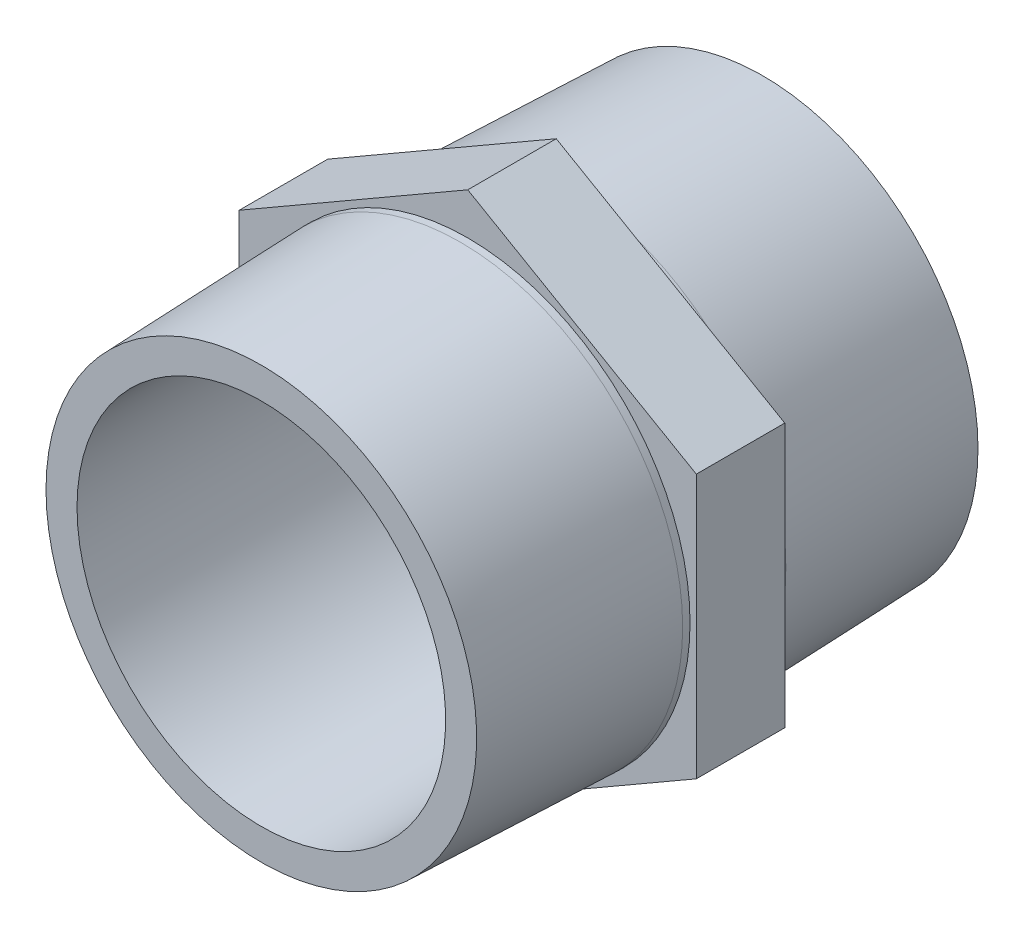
ISO-10303-21;
HEADER;
FILE_DESCRIPTION(('STEP AP214'),'2;1');
FILE_NAME('part.step','',(''),(''),'','','');
FILE_SCHEMA(('AUTOMOTIVE_DESIGN { 1 0 10303 214 1 1 1 1 }'));
ENDSEC;
DATA;
#1=APPLICATION_CONTEXT('core data for automotive mechanical design processes');
#2=APPLICATION_PROTOCOL_DEFINITION('international standard','automotive_design',2000,#1);
#3=PRODUCT_CONTEXT('',#1,'mechanical');
#4=PRODUCT('Part','Part','',(#3));
#5=PRODUCT_RELATED_PRODUCT_CATEGORY('part','',(#4));
#6=PRODUCT_DEFINITION_FORMATION('','',#4);
#7=PRODUCT_DEFINITION_CONTEXT('part definition',#1,'design');
#8=PRODUCT_DEFINITION('design','',#6,#7);
#9=PRODUCT_DEFINITION_SHAPE('','',#8);
#10=(LENGTH_UNIT() NAMED_UNIT(*) SI_UNIT(.MILLI.,.METRE.));
#11=(NAMED_UNIT(*) PLANE_ANGLE_UNIT() SI_UNIT($,.RADIAN.));
#12=(NAMED_UNIT(*) SI_UNIT($,.STERADIAN.) SOLID_ANGLE_UNIT());
#13=UNCERTAINTY_MEASURE_WITH_UNIT(LENGTH_MEASURE(1.E-05),#10,'distance_accuracy_value','');
#14=(GEOMETRIC_REPRESENTATION_CONTEXT(3) GLOBAL_UNCERTAINTY_ASSIGNED_CONTEXT((#13)) GLOBAL_UNIT_ASSIGNED_CONTEXT((#10,
#11,#12)) REPRESENTATION_CONTEXT('',''));
#15=CARTESIAN_POINT('',(0.,0.,0.));
#16=DIRECTION('',(0.,0.,1.));
#17=DIRECTION('',(1.,0.,0.));
#18=AXIS2_PLACEMENT_3D('',#15,#16,#17);
#19=CARTESIAN_POINT('',(30.15,0.,-6.));
#20=DIRECTION('',(0.,0.,1.));
#21=DIRECTION('',(1.,0.,0.));
#22=AXIS2_PLACEMENT_3D('',#19,#20,#21);
#23=PLANE('',#22);
#24=CARTESIAN_POINT('',(0.,0.,-6.));
#25=DIRECTION('',(0.,0.,-1.));
#26=DIRECTION('',(-1.,0.,0.));
#27=AXIS2_PLACEMENT_3D('',#24,#25,#26);
#28=CIRCLE('',#27,30.15);
#29=CARTESIAN_POINT('',(-30.15,0.,-6.));
#30=VERTEX_POINT('',#29);
#31=EDGE_CURVE('E146',#30,#30,#28,.T.);
#32=ORIENTED_EDGE('',*,*,#31,.F.);
#33=EDGE_LOOP('',(#32));
#34=FACE_BOUND('',#33,.T.);
#35=DIRECTION('',(0.866025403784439,-0.5,0.));
#36=VECTOR('',#35,1.);
#37=CARTESIAN_POINT('',(7.1125,-39.902120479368,-6.));
#38=LINE('',#37,#36);
#39=CARTESIAN_POINT('',(-31.,-17.8978583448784,-6.));
#40=VERTEX_POINT('',#39);
#41=CARTESIAN_POINT('',(0.,-35.7957166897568,-6.));
#42=VERTEX_POINT('',#41);
#43=EDGE_CURVE('E135',#40,#42,#38,.T.);
#44=ORIENTED_EDGE('',*,*,#43,.F.);
#45=DIRECTION('',(0.,-1.,0.));
#46=VECTOR('',#45,1.);
#47=CARTESIAN_POINT('',(-31.,0.,-6.));
#48=LINE('',#47,#46);
#49=CARTESIAN_POINT('',(-31.,17.8978583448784,-6.));
#50=VERTEX_POINT('',#49);
#51=EDGE_CURVE('E133',#50,#40,#48,.T.);
#52=ORIENTED_EDGE('',*,*,#51,.F.);
#53=DIRECTION('',(-0.866025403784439,-0.5,0.));
#54=VECTOR('',#53,1.);
#55=CARTESIAN_POINT('',(7.1125,39.902120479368,-6.));
#56=LINE('',#55,#54);
#57=CARTESIAN_POINT('',(0.,35.7957166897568,-6.));
#58=VERTEX_POINT('',#57);
#59=EDGE_CURVE('E131',#58,#50,#56,.T.);
#60=ORIENTED_EDGE('',*,*,#59,.F.);
#61=DIRECTION('',(-0.866025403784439,0.5,0.));
#62=VECTOR('',#61,1.);
#63=CARTESIAN_POINT('',(38.1125,13.7914545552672,-6.));
#64=LINE('',#63,#62);
#65=CARTESIAN_POINT('',(31.,17.8978583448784,-6.));
#66=VERTEX_POINT('',#65);
#67=EDGE_CURVE('E129',#66,#58,#64,.T.);
#68=ORIENTED_EDGE('',*,*,#67,.F.);
#69=DIRECTION('',(0.,1.,0.));
#70=VECTOR('',#69,1.);
#71=CARTESIAN_POINT('',(31.,0.,-6.));
#72=LINE('',#71,#70);
#73=CARTESIAN_POINT('',(31.,-17.8978583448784,-6.));
#74=VERTEX_POINT('',#73);
#75=EDGE_CURVE('E91',#74,#66,#72,.T.);
#76=ORIENTED_EDGE('',*,*,#75,.F.);
#77=DIRECTION('',(0.866025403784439,0.5,0.));
#78=VECTOR('',#77,1.);
#79=CARTESIAN_POINT('',(38.1125,-13.7914545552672,-6.));
#80=LINE('',#79,#78);
#81=EDGE_CURVE('E121',#42,#74,#80,.T.);
#82=ORIENTED_EDGE('',*,*,#81,.F.);
#83=EDGE_LOOP('',(#44,#52,#60,#68,#76,#82));
#84=FACE_BOUND('',#83,.T.);
#85=ADVANCED_FACE('F35',(#34,#84),#23,.F.);
#86=CARTESIAN_POINT('',(50.,0.,6.));
#87=DIRECTION('',(0.,0.,-1.));
#88=DIRECTION('',(-1.,0.,0.));
#89=AXIS2_PLACEMENT_3D('',#86,#87,#88);
#90=PLANE('',#89);
#91=CARTESIAN_POINT('',(0.,0.,6.00000000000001));
#92=DIRECTION('',(0.,0.,-1.));
#93=DIRECTION('',(-1.,0.,0.));
#94=AXIS2_PLACEMENT_3D('',#91,#92,#93);
#95=CIRCLE('',#94,30.15);
#96=CARTESIAN_POINT('',(-30.15,0.,6.00000000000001));
#97=VERTEX_POINT('',#96);
#98=EDGE_CURVE('E143',#97,#97,#95,.T.);
#99=ORIENTED_EDGE('',*,*,#98,.T.);
#100=EDGE_LOOP('',(#99));
#101=FACE_BOUND('',#100,.T.);
#102=DIRECTION('',(0.866025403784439,-0.5,0.));
#103=VECTOR('',#102,1.);
#104=CARTESIAN_POINT('',(-31.,-17.8978583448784,6.));
#105=LINE('',#104,#103);
#106=CARTESIAN_POINT('',(-31.,-17.8978583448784,6.));
#107=VERTEX_POINT('',#106);
#108=CARTESIAN_POINT('',(0.,-35.7957166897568,6.));
#109=VERTEX_POINT('',#108);
#110=EDGE_CURVE('E111',#107,#109,#105,.T.);
#111=ORIENTED_EDGE('',*,*,#110,.T.);
#112=DIRECTION('',(0.866025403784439,0.5,0.));
#113=VECTOR('',#112,1.);
#114=CARTESIAN_POINT('',(0.,-35.7957166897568,6.));
#115=LINE('',#114,#113);
#116=CARTESIAN_POINT('',(31.,-17.8978583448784,6.));
#117=VERTEX_POINT('',#116);
#118=EDGE_CURVE('E109',#109,#117,#115,.T.);
#119=ORIENTED_EDGE('',*,*,#118,.T.);
#120=DIRECTION('',(0.,1.,0.));
#121=VECTOR('',#120,1.);
#122=CARTESIAN_POINT('',(31.,-17.8978583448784,6.));
#123=LINE('',#122,#121);
#124=CARTESIAN_POINT('',(31.,17.8978583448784,6.));
#125=VERTEX_POINT('',#124);
#126=EDGE_CURVE('E58',#117,#125,#123,.T.);
#127=ORIENTED_EDGE('',*,*,#126,.T.);
#128=DIRECTION('',(-0.866025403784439,0.5,0.));
#129=VECTOR('',#128,1.);
#130=CARTESIAN_POINT('',(31.,17.8978583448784,6.));
#131=LINE('',#130,#129);
#132=CARTESIAN_POINT('',(0.,35.7957166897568,6.));
#133=VERTEX_POINT('',#132);
#134=EDGE_CURVE('E98',#125,#133,#131,.T.);
#135=ORIENTED_EDGE('',*,*,#134,.T.);
#136=DIRECTION('',(-0.866025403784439,-0.5,0.));
#137=VECTOR('',#136,1.);
#138=CARTESIAN_POINT('',(0.,35.7957166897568,6.));
#139=LINE('',#138,#137);
#140=CARTESIAN_POINT('',(-31.,17.8978583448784,6.));
#141=VERTEX_POINT('',#140);
#142=EDGE_CURVE('E104',#133,#141,#139,.T.);
#143=ORIENTED_EDGE('',*,*,#142,.T.);
#144=DIRECTION('',(0.,-1.,0.));
#145=VECTOR('',#144,1.);
#146=CARTESIAN_POINT('',(-31.,17.8978583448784,6.));
#147=LINE('',#146,#145);
#148=EDGE_CURVE('E116',#141,#107,#147,.T.);
#149=ORIENTED_EDGE('',*,*,#148,.T.);
#150=EDGE_LOOP('',(#111,#119,#127,#135,#143,#149));
#151=FACE_BOUND('',#150,.T.);
#152=ADVANCED_FACE('F108',(#101,#151),#90,.F.);
#153=CARTESIAN_POINT('',(25.,0.,-34.));
#154=DIRECTION('',(0.,0.,1.));
#155=DIRECTION('',(1.,0.,0.));
#156=AXIS2_PLACEMENT_3D('',#153,#154,#155);
#157=PLANE('',#156);
#158=CARTESIAN_POINT('',(0.,0.,-34.));
#159=DIRECTION('',(0.,0.,1.));
#160=DIRECTION('',(1.,0.,0.));
#161=AXIS2_PLACEMENT_3D('',#158,#159,#160);
#162=CIRCLE('',#161,29.2071392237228);
#163=CARTESIAN_POINT('',(29.2071392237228,0.,-34.));
#164=VERTEX_POINT('',#163);
#165=EDGE_CURVE('E149',#164,#164,#162,.F.);
#166=ORIENTED_EDGE('',*,*,#165,.T.);
#167=EDGE_LOOP('',(#166));
#168=FACE_BOUND('',#167,.T.);
#169=CARTESIAN_POINT('',(0.,0.,-34.));
#170=DIRECTION('',(0.,0.,-1.));
#171=DIRECTION('',(-1.,0.,0.));
#172=AXIS2_PLACEMENT_3D('',#169,#170,#171);
#173=CIRCLE('',#172,25.);
#174=CARTESIAN_POINT('',(-25.,0.,-34.));
#175=VERTEX_POINT('',#174);
#176=EDGE_CURVE('E137',#175,#175,#173,.T.);
#177=ORIENTED_EDGE('',*,*,#176,.F.);
#178=EDGE_LOOP('',(#177));
#179=FACE_BOUND('',#178,.T.);
#180=ADVANCED_FACE('F175',(#168,#179),#157,.F.);
#181=CARTESIAN_POINT('',(0.,0.,-34.));
#182=DIRECTION('',(0.,0.,-1.));
#183=DIRECTION('',(-1.,0.,0.));
#184=AXIS2_PLACEMENT_3D('',#181,#182,#183);
#185=CYLINDRICAL_SURFACE('',#184,30.15);
#186=CARTESIAN_POINT('',(0.,0.,-6.99999999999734));
#187=DIRECTION('',(0.,0.,1.));
#188=DIRECTION('',(1.,0.,0.));
#189=AXIS2_PLACEMENT_3D('',#186,#187,#188);
#190=CIRCLE('',#189,30.15);
#191=CARTESIAN_POINT('',(30.15,0.,-6.99999999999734));
#192=VERTEX_POINT('',#191);
#193=EDGE_CURVE('E152',#192,#192,#190,.T.);
#194=ORIENTED_EDGE('',*,*,#193,.T.);
#195=EDGE_LOOP('',(#194));
#196=FACE_BOUND('',#195,.T.);
#197=ORIENTED_EDGE('',*,*,#31,.T.);
#198=EDGE_LOOP('',(#197));
#199=FACE_BOUND('',#198,.T.);
#200=ADVANCED_FACE('F182',(#196,#199),#185,.T.);
#201=CARTESIAN_POINT('',(0.,0.,-34.));
#202=DIRECTION('',(0.,0.,-1.));
#203=DIRECTION('',(-1.,0.,0.));
#204=AXIS2_PLACEMENT_3D('',#201,#202,#203);
#205=CYLINDRICAL_SURFACE('',#204,30.15);
#206=CARTESIAN_POINT('',(0.,0.,6.99999999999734));
#207=DIRECTION('',(0.,0.,-1.));
#208=DIRECTION('',(-1.,0.,0.));
#209=AXIS2_PLACEMENT_3D('',#206,#207,#208);
#210=CIRCLE('',#209,30.15);
#211=CARTESIAN_POINT('',(-30.15,0.,6.99999999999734));
#212=VERTEX_POINT('',#211);
#213=EDGE_CURVE('E43',#212,#212,#210,.T.);
#214=ORIENTED_EDGE('',*,*,#213,.T.);
#215=EDGE_LOOP('',(#214));
#216=FACE_BOUND('',#215,.T.);
#217=ORIENTED_EDGE('',*,*,#98,.F.);
#218=EDGE_LOOP('',(#217));
#219=FACE_BOUND('',#218,.T.);
#220=ADVANCED_FACE('F157',(#216,#219),#205,.T.);
#221=CARTESIAN_POINT('',(25.,0.,34.));
#222=DIRECTION('',(0.,0.,-1.));
#223=DIRECTION('',(-1.,0.,0.));
#224=AXIS2_PLACEMENT_3D('',#221,#222,#223);
#225=PLANE('',#224);
#226=CARTESIAN_POINT('',(0.,0.,34.));
#227=DIRECTION('',(0.,0.,-1.));
#228=DIRECTION('',(-1.,0.,0.));
#229=AXIS2_PLACEMENT_3D('',#226,#227,#228);
#230=CIRCLE('',#229,29.2071392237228);
#231=CARTESIAN_POINT('',(-29.2071392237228,0.,34.));
#232=VERTEX_POINT('',#231);
#233=EDGE_CURVE('E12',#232,#232,#230,.F.);
#234=ORIENTED_EDGE('',*,*,#233,.T.);
#235=EDGE_LOOP('',(#234));
#236=FACE_BOUND('',#235,.T.);
#237=CARTESIAN_POINT('',(0.,0.,34.));
#238=DIRECTION('',(0.,0.,-1.));
#239=DIRECTION('',(-1.,0.,0.));
#240=AXIS2_PLACEMENT_3D('',#237,#238,#239);
#241=CIRCLE('',#240,25.);
#242=CARTESIAN_POINT('',(-25.,0.,34.));
#243=VERTEX_POINT('',#242);
#244=EDGE_CURVE('E140',#243,#243,#241,.T.);
#245=ORIENTED_EDGE('',*,*,#244,.T.);
#246=EDGE_LOOP('',(#245));
#247=FACE_BOUND('',#246,.T.);
#248=ADVANCED_FACE('F197',(#236,#247),#225,.F.);
#249=CARTESIAN_POINT('',(0.,0.,-34.));
#250=DIRECTION('',(0.,0.,-1.));
#251=DIRECTION('',(-1.,0.,0.));
#252=AXIS2_PLACEMENT_3D('',#249,#250,#251);
#253=CYLINDRICAL_SURFACE('',#252,25.);
#254=ORIENTED_EDGE('',*,*,#244,.F.);
#255=EDGE_LOOP('',(#254));
#256=FACE_BOUND('',#255,.T.);
#257=ORIENTED_EDGE('',*,*,#176,.T.);
#258=EDGE_LOOP('',(#257));
#259=FACE_BOUND('',#258,.T.);
#260=ADVANCED_FACE('F194',(#256,#259),#253,.F.);
#261=CARTESIAN_POINT('',(-31.,-17.8978583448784,-34.));
#262=DIRECTION('',(-0.5,-0.866025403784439,0.));
#263=DIRECTION('',(0.866025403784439,-0.5,0.));
#264=AXIS2_PLACEMENT_3D('',#261,#262,#263);
#265=PLANE('',#264);
#266=ORIENTED_EDGE('',*,*,#43,.T.);
#267=DIRECTION('',(0.,0.,1.));
#268=VECTOR('',#267,1.);
#269=CARTESIAN_POINT('',(0.,-35.7957166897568,-34.));
#270=LINE('',#269,#268);
#271=EDGE_CURVE('E50',#42,#109,#270,.T.);
#272=ORIENTED_EDGE('',*,*,#271,.T.);
#273=ORIENTED_EDGE('',*,*,#110,.F.);
#274=DIRECTION('',(0.,0.,1.));
#275=VECTOR('',#274,1.);
#276=CARTESIAN_POINT('',(-31.,-17.8978583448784,-34.));
#277=LINE('',#276,#275);
#278=EDGE_CURVE('E119',#40,#107,#277,.T.);
#279=ORIENTED_EDGE('',*,*,#278,.F.);
#280=EDGE_LOOP('',(#266,#272,#273,#279));
#281=FACE_BOUND('',#280,.T.);
#282=ADVANCED_FACE('F196',(#281),#265,.T.);
#283=CARTESIAN_POINT('',(-31.,17.8978583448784,-34.));
#284=DIRECTION('',(-1.,0.,0.));
#285=DIRECTION('',(0.,-1.,0.));
#286=AXIS2_PLACEMENT_3D('',#283,#284,#285);
#287=PLANE('',#286);
#288=ORIENTED_EDGE('',*,*,#51,.T.);
#289=ORIENTED_EDGE('',*,*,#278,.T.);
#290=ORIENTED_EDGE('',*,*,#148,.F.);
#291=DIRECTION('',(0.,0.,1.));
#292=VECTOR('',#291,1.);
#293=CARTESIAN_POINT('',(-31.,17.8978583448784,-34.));
#294=LINE('',#293,#292);
#295=EDGE_CURVE('E122',#50,#141,#294,.T.);
#296=ORIENTED_EDGE('',*,*,#295,.F.);
#297=EDGE_LOOP('',(#288,#289,#290,#296));
#298=FACE_BOUND('',#297,.T.);
#299=ADVANCED_FACE('F204',(#298),#287,.T.);
#300=CARTESIAN_POINT('',(0.,35.7957166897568,-34.));
#301=DIRECTION('',(-0.5,0.866025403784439,0.));
#302=DIRECTION('',(-0.866025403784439,-0.5,0.));
#303=AXIS2_PLACEMENT_3D('',#300,#301,#302);
#304=PLANE('',#303);
#305=ORIENTED_EDGE('',*,*,#59,.T.);
#306=ORIENTED_EDGE('',*,*,#295,.T.);
#307=ORIENTED_EDGE('',*,*,#142,.F.);
#308=DIRECTION('',(0.,0.,1.));
#309=VECTOR('',#308,1.);
#310=CARTESIAN_POINT('',(0.,35.7957166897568,-34.));
#311=LINE('',#310,#309);
#312=EDGE_CURVE('E94',#58,#133,#311,.T.);
#313=ORIENTED_EDGE('',*,*,#312,.F.);
#314=EDGE_LOOP('',(#305,#306,#307,#313));
#315=FACE_BOUND('',#314,.T.);
#316=ADVANCED_FACE('F253',(#315),#304,.T.);
#317=CARTESIAN_POINT('',(31.,17.8978583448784,-34.));
#318=DIRECTION('',(0.5,0.866025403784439,0.));
#319=DIRECTION('',(-0.866025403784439,0.5,0.));
#320=AXIS2_PLACEMENT_3D('',#317,#318,#319);
#321=PLANE('',#320);
#322=ORIENTED_EDGE('',*,*,#67,.T.);
#323=ORIENTED_EDGE('',*,*,#312,.T.);
#324=ORIENTED_EDGE('',*,*,#134,.F.);
#325=DIRECTION('',(0.,0.,1.));
#326=VECTOR('',#325,1.);
#327=CARTESIAN_POINT('',(31.,17.8978583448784,-34.));
#328=LINE('',#327,#326);
#329=EDGE_CURVE('E87',#66,#125,#328,.T.);
#330=ORIENTED_EDGE('',*,*,#329,.F.);
#331=EDGE_LOOP('',(#322,#323,#324,#330));
#332=FACE_BOUND('',#331,.T.);
#333=ADVANCED_FACE('F99',(#332),#321,.T.);
#334=CARTESIAN_POINT('',(31.,-17.8978583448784,-34.));
#335=DIRECTION('',(1.,0.,0.));
#336=DIRECTION('',(0.,0.,-1.));
#337=AXIS2_PLACEMENT_3D('',#334,#335,#336);
#338=PLANE('',#337);
#339=ORIENTED_EDGE('',*,*,#75,.T.);
#340=ORIENTED_EDGE('',*,*,#329,.T.);
#341=ORIENTED_EDGE('',*,*,#126,.F.);
#342=DIRECTION('',(0.,0.,1.));
#343=VECTOR('',#342,1.);
#344=CARTESIAN_POINT('',(31.,-17.8978583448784,-34.));
#345=LINE('',#344,#343);
#346=EDGE_CURVE('E95',#74,#117,#345,.T.);
#347=ORIENTED_EDGE('',*,*,#346,.F.);
#348=EDGE_LOOP('',(#339,#340,#341,#347));
#349=FACE_BOUND('',#348,.T.);
#350=ADVANCED_FACE('F89',(#349),#338,.T.);
#351=CARTESIAN_POINT('',(0.,-35.7957166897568,-34.));
#352=DIRECTION('',(0.5,-0.866025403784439,0.));
#353=DIRECTION('',(0.866025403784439,0.5,0.));
#354=AXIS2_PLACEMENT_3D('',#351,#352,#353);
#355=PLANE('',#354);
#356=ORIENTED_EDGE('',*,*,#81,.T.);
#357=ORIENTED_EDGE('',*,*,#346,.T.);
#358=ORIENTED_EDGE('',*,*,#118,.F.);
#359=ORIENTED_EDGE('',*,*,#271,.F.);
#360=EDGE_LOOP('',(#356,#357,#358,#359));
#361=FACE_BOUND('',#360,.T.);
#362=ADVANCED_FACE('F166',(#361),#355,.T.);
#363=CARTESIAN_POINT('',(0.,0.,-34.));
#364=DIRECTION('',(0.,0.,1.));
#365=DIRECTION('',(1.,0.,0.));
#366=AXIS2_PLACEMENT_3D('',#363,#364,#365);
#367=CONICAL_SURFACE('',#366,29.2071392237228,0.0349065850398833);
#368=ORIENTED_EDGE('',*,*,#193,.F.);
#369=EDGE_LOOP('',(#368));
#370=FACE_BOUND('',#369,.T.);
#371=ORIENTED_EDGE('',*,*,#165,.F.);
#372=EDGE_LOOP('',(#371));
#373=FACE_BOUND('',#372,.T.);
#374=ADVANCED_FACE('F161',(#370,#373),#367,.T.);
#375=CARTESIAN_POINT('',(0.,0.,6.99999999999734));
#376=DIRECTION('',(0.,0.,-1.));
#377=DIRECTION('',(-1.,0.,0.));
#378=AXIS2_PLACEMENT_3D('',#375,#376,#377);
#379=CONICAL_SURFACE('',#378,30.15,0.0349065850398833);
#380=ORIENTED_EDGE('',*,*,#233,.F.);
#381=EDGE_LOOP('',(#380));
#382=FACE_BOUND('',#381,.T.);
#383=ORIENTED_EDGE('',*,*,#213,.F.);
#384=EDGE_LOOP('',(#383));
#385=FACE_BOUND('',#384,.T.);
#386=ADVANCED_FACE('F37',(#382,#385),#379,.T.);
#387=CLOSED_SHELL('',(#85,#152,#180,#200,#220,#248,#260,#282,#299,#316,#333,#350,#362,#374,#386));
#388=MANIFOLD_SOLID_BREP('B2',#387);
#389=ADVANCED_BREP_SHAPE_REPRESENTATION('',(#18,#388),#14);
#390=SHAPE_DEFINITION_REPRESENTATION(#9,#389);
ENDSEC;
END-ISO-10303-21;
